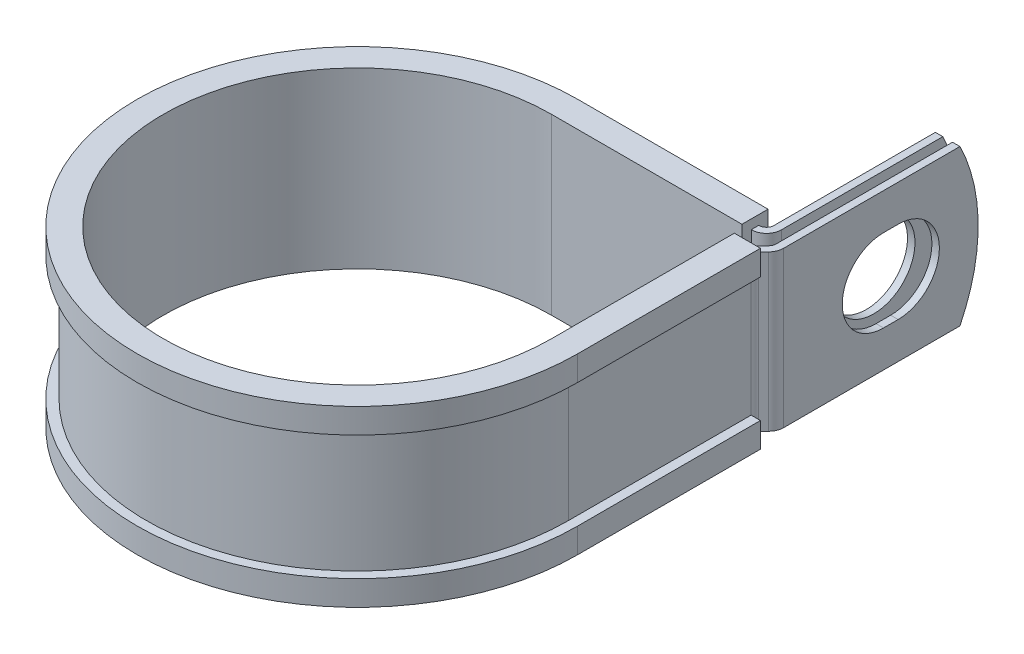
from build123d import *

# Parameters (mm, degrees)
EXTRUDE_THIN1_DEPTH = 12.7
SKETCH2_R           = 6.7437
CUT_EXTRUDE1_DEPTH  = 1.2192
CUT_EXTRUDE2_DEPTH  = 1.2192
CUT_EXTRUDE3_DEPTH  = 95.168498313


with BuildPart() as part:
    # Sketch1 → Extrude-Thin1 (new, symmetric)
    with BuildSketch(Plane(origin=(0, 0, 0), x_dir=(1, 0, 0), z_dir=(0, 1, 0))):
        with BuildLine():
            Line((35.1714698, 65.0748), (35.1714698, 33.274))
            ThreePointArc((35.1714698, 33.274), (35.078663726, 32.807432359), (34.814374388, 32.411895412))
            Line((34.814374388, 32.411895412), (33.988190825, 31.585711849))
            ThreePointArc((33.988190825, 31.585711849), (33.459612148, 30.794637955), (33.274, 29.861502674))
            Line((33.274, 29.861502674), (33.274, 0))
            ThreePointArc((33.274, 0), (-23.528271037, -23.528271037), (0, 33.274))
            Line((0, 33.274), (31.1582698, 33.274))
            ThreePointArc((31.1582698, 33.274), (32.882478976, 33.988190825), (33.5966698, 35.7124))
            Line((33.5966698, 35.7124), (33.5966698, 65.0748))
            Line((33.5966698, 65.0748), (32.3774698, 65.0748))
            Line((32.3774698, 65.0748), (32.3774698, 35.7124))
            ThreePointArc((32.3774698, 35.7124), (32.020374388, 34.850295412), (31.1582698, 34.4932))
            Line((31.1582698, 34.4932), (0, 34.4932))
            ThreePointArc((0, 34.4932), (-24.390375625, -24.390375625), (34.4932, 0))
            Line((34.4932, 0), (34.4932, 29.861502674))
            ThreePointArc((34.4932, 29.861502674), (34.586006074, 30.328070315), (34.850295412, 30.723607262))
            Line((34.850295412, 30.723607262), (35.676478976, 31.549790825))
            ThreePointArc((35.676478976, 31.549790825), (36.205057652, 32.340864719), (36.3906698, 33.274))
            Line((36.3906698, 33.274), (36.3906698, 65.0748))
            Line((36.3906698, 65.0748), (35.1714698, 65.0748))
        make_face()
    extrude(amount=EXTRUDE_THIN1_DEPTH, both=True)

    # Sketch2 → Cut-Extrude1 (cut)
    with BuildSketch(Plane.ZY.offset(-32.3774698)):
        with Locations((-50.8, 0)):
            Circle(SKETCH2_R)
    extrude(amount=-CUT_EXTRUDE1_DEPTH, mode=Mode.SUBTRACT)

    # Sketch3 → Cut-Extrude2 (cut)
    with BuildSketch(Plane(origin=(36.3906698, 0, 0), x_dir=(0, 0, -1), z_dir=(1, 0, 0))):
        with BuildLine():
            Line((49.6062, 6.7437), (51.9938, 6.7437))
            ThreePointArc((51.9938, 6.7437), (58.7375, 0), (51.9938, -6.7437))
            Line((51.9938, -6.7437), (49.6062, -6.7437))
            ThreePointArc((49.6062, -6.7437), (42.8625, 0), (49.6062, 6.7437))
        make_face()
    extrude(amount=-CUT_EXTRUDE2_DEPTH, mode=Mode.SUBTRACT)

    # Sketch4 → Cut-Extrude3 (cut, through all)
    with BuildSketch(Plane.ZY.offset(-32.3774698)):
        with BuildLine():
            Line((-62.097468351, 12.7), (-65.0748, 12.7))
            Line((-65.0748, 12.7), (-65.0748, 0))
            ThreePointArc((-65.0748, 0), (-64.320511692, 6.522164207), (-62.097468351, 12.7))
        make_face()
        with BuildLine():
            ThreePointArc((-62.097468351, -12.7), (-64.320511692, -6.522164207), (-65.0748, 0))
            Line((-65.0748, 0), (-65.0748, -12.7))
            Line((-65.0748, -12.7), (-62.097468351, -12.7))
        make_face()
    extrude(amount=-CUT_EXTRUDE3_DEPTH, mode=Mode.SUBTRACT)

    # Sweep1: sweep along a path in Sketch6
    with BuildLine(Plane(origin=(0, 12.7, 0), x_dir=(1, 0, 0), z_dir=(0, 1, 0))) as sweep1_path:
        Line((31.75, 29.861502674), (31.75, 0))
        ThreePointArc((31.75, 0), (-22.450640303, -22.450640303), (0, 31.75))
        Line((0, 31.75), (31.1074698, 31.75))
    # Sketch5 → Sweep1 (sweep)
    with BuildSketch(Plane(origin=(0, 0, -29.861502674), x_dir=(-1, 0, 0), z_dir=(0, 0, -1))):
        Polygon((-34.4932, 12.7), (-33.274, 12.7), (-33.274, -12.7), (-34.4932, -12.7), (-34.4932, -10.16), (-36.0172, -10.16), (-36.0172, -14.224), (-31.75, -14.224), (-31.75, 14.224), (-36.0172, 14.224), (-36.0172, 10.16), (-34.4932, 10.16), align=None)
    sweep(path=sweep1_path.line)


solid = part.part
